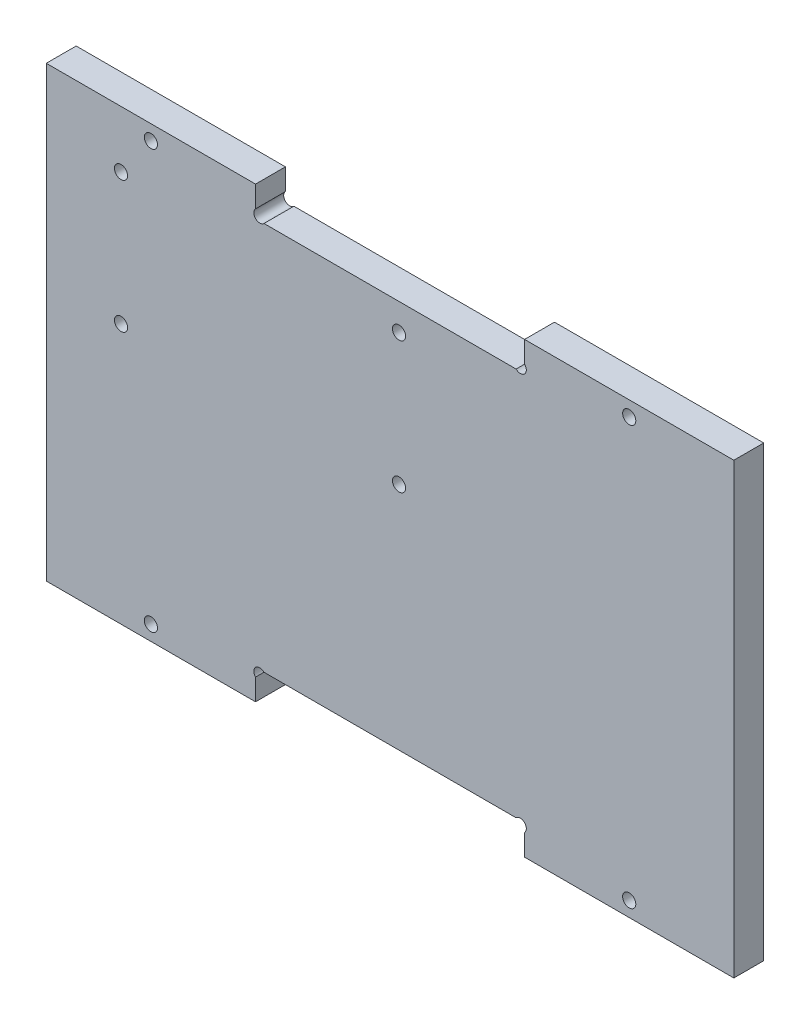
from build123d import *

# Parameters (mm, degrees)
ESQUISSE1_W               = 115
ESQUISSE1_H               = 75
BOSS_EXTRU_1_DEPTH        = 5
ENL_V_MAT_EXTRU_2_REACH   = 139.386
ESQUISSE3_R               = 1.1
ENL_V_MAT_EXTRU_4_REACH   = 139.386
ESQUISSE6_W               = 45
ESQUISSE6_H               = 5
ENL_V_START               = -5
ESQUISSE7_R               = 1
ENL_V_MAT_EXTRU_5_DEPTH   = 5
ENL_V_MAT_EXTRU_6_REACH   = 139.386
ESQUISSE8_R               = 1.1
SYM_TRIE2_COPY_1_REACH    = 139.386
SYM_TRIE2_COPY_1_SKETCH_R = 1.1


with BuildPart() as part:
    # Esquisse1 → Boss.-Extru.1 (new body)
    with BuildSketch(Plane.XY):
        with Locations((57.5, 37.5)):
            Rectangle(ESQUISSE1_W, ESQUISSE1_H)
    extrude(amount=BOSS_EXTRU_1_DEPTH)

    # Esquisse3 → Enl_v. mat.-Extru.2 (cut, up to next)
    with BuildSketch(Plane.XY.offset(5), mode=Mode.PRIVATE) as enl_v_mat_extru_2_sk1:
        with Locations((12.5, 65.5)):
            Circle(ESQUISSE3_R)
    enl_v_mat_extru_2_tool1 = extrude(enl_v_mat_extru_2_sk1.sketch, amount=-ENL_V_MAT_EXTRU_2_REACH, mode=Mode.PRIVATE) & part.part
    # Esquisse3 → Enl_v. mat.-Extru.2 (cut, up to next)
    with BuildSketch(Plane.XY.offset(5), mode=Mode.PRIVATE) as enl_v_mat_extru_2_sk2:
        with Locations((59, 65.5)):
            Circle(ESQUISSE3_R)
    enl_v_mat_extru_2_tool2 = extrude(enl_v_mat_extru_2_sk2.sketch, amount=-ENL_V_MAT_EXTRU_2_REACH, mode=Mode.PRIVATE) & part.part
    # Esquisse3 → Enl_v. mat.-Extru.2 (cut, up to next)
    with BuildSketch(Plane.XY.offset(5), mode=Mode.PRIVATE) as enl_v_mat_extru_2_sk3:
        with Locations((59, 43.5)):
            Circle(ESQUISSE3_R)
    enl_v_mat_extru_2_tool3 = extrude(enl_v_mat_extru_2_sk3.sketch, amount=-ENL_V_MAT_EXTRU_2_REACH, mode=Mode.PRIVATE) & part.part
    # Esquisse3 → Enl_v. mat.-Extru.2 (cut, up to next)
    with BuildSketch(Plane.XY.offset(5), mode=Mode.PRIVATE) as enl_v_mat_extru_2_sk4:
        with Locations((12.5, 43.5)):
            Circle(ESQUISSE3_R)
    enl_v_mat_extru_2_tool4 = extrude(enl_v_mat_extru_2_sk4.sketch, amount=-ENL_V_MAT_EXTRU_2_REACH, mode=Mode.PRIVATE) & part.part
    add(enl_v_mat_extru_2_tool1.solids().sort_by_distance((12.5, 65.5, 5))[0], mode=Mode.SUBTRACT)
    add(enl_v_mat_extru_2_tool2.solids().sort_by_distance((59, 65.5, 5))[0], mode=Mode.SUBTRACT)
    add(enl_v_mat_extru_2_tool3.solids().sort_by_distance((59, 43.5, 5))[0], mode=Mode.SUBTRACT)
    add(enl_v_mat_extru_2_tool4.solids().sort_by_distance((12.5, 43.5, 5))[0], mode=Mode.SUBTRACT)

    # Esquisse6 → Enl_v. mat.-Extru.4 (cut, up to next)
    with BuildSketch(Plane(origin=(0, 0, 0), x_dir=(-1, 0, 0), z_dir=(0, 0, -1)), mode=Mode.PRIVATE) as enl_v_mat_extru_4_sk1:
        with Locations((-57.5, 72.5)):
            Rectangle(ESQUISSE6_W, ESQUISSE6_H)
    enl_v_mat_extru_4_tool1 = extrude(enl_v_mat_extru_4_sk1.sketch, amount=-ENL_V_MAT_EXTRU_4_REACH, mode=Mode.PRIVATE) & part.part
    # Esquisse6 → Enl_v. mat.-Extru.4 (cut, up to next)
    with BuildSketch(Plane(origin=(0, 0, 0), x_dir=(-1, 0, 0), z_dir=(0, 0, -1)), mode=Mode.PRIVATE) as enl_v_mat_extru_4_sk2:
        with Locations((-57.5, 2.5)):
            Rectangle(ESQUISSE6_W, ESQUISSE6_H)
    enl_v_mat_extru_4_tool2 = extrude(enl_v_mat_extru_4_sk2.sketch, amount=-ENL_V_MAT_EXTRU_4_REACH, mode=Mode.PRIVATE) & part.part
    add(enl_v_mat_extru_4_tool1.solids().sort_by_distance((57.5, 72.5, 0))[0], mode=Mode.SUBTRACT)
    add(enl_v_mat_extru_4_tool2.solids().sort_by_distance((57.5, 2.5, 0))[0], mode=Mode.SUBTRACT)

    # Esquisse7 → Enl_v. mat.-Extru.5 (cut)
    with BuildSketch(Plane(origin=(0, 0, 0), x_dir=(-1, 0, 0), z_dir=(0, 0, -1)).offset(ENL_V_START)):
        with Locations((-35.707106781, 70.707106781)):
            Circle(ESQUISSE7_R)
        with Locations((-79.292893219, 70.707106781)):
            Circle(ESQUISSE7_R)
        with Locations((-79.292893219, 4.292893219)):
            Circle(ESQUISSE7_R)
        with Locations((-35.707106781, 4.292893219)):
            Circle(ESQUISSE7_R)
    extrude(amount=ENL_V_MAT_EXTRU_5_DEPTH, mode=Mode.SUBTRACT)

    # Esquisse8 → Enl_v. mat.-Extru.6 (cut, up to next)
    with BuildSketch(Plane(origin=(0, 0, 0), x_dir=(-1, 0, 0), z_dir=(0, 0, -1)), mode=Mode.PRIVATE) as enl_v_mat_extru_6_sk1:
        with Locations((-17.5, 72.5)):
            Circle(ESQUISSE8_R)
    enl_v_mat_extru_6_tool1 = extrude(enl_v_mat_extru_6_sk1.sketch, amount=-ENL_V_MAT_EXTRU_6_REACH, mode=Mode.PRIVATE) & part.part
    enl_v_mat_extru_6 = enl_v_mat_extru_6_tool1.solids().sort_by_distance((17.5, 72.5, 0))[0]
    add(enl_v_mat_extru_6, mode=Mode.SUBTRACT)

    # Sym_trie1: Enl_v. mat.-Extru.6 across plane
    add(enl_v_mat_extru_6.mirror(Plane(origin=(57.5, 0, 0), x_dir=(0, 0, 1), z_dir=(1, 0, 0))), mode=Mode.SUBTRACT)

    # Sym_trie2: Enl_v. mat.-Extru.6 across plane
    add(enl_v_mat_extru_6.mirror(Plane.ZX.offset(37.5)), mode=Mode.SUBTRACT)

    # Sym_trie2 copy 1 sketch → Sym_trie2 copy 1 (cut, up to next)
    with BuildSketch(Plane(origin=(115, 75, 0), x_dir=(1, 0, 0), z_dir=(0, 0, -1)), mode=Mode.PRIVATE) as sym_trie2_copy_1_sk1:
        with Locations((-17.5, 72.5)):
            Circle(SYM_TRIE2_COPY_1_SKETCH_R)
    sym_trie2_copy_1_tool1 = extrude(sym_trie2_copy_1_sk1.sketch, amount=-SYM_TRIE2_COPY_1_REACH, mode=Mode.PRIVATE) & part.part
    add(sym_trie2_copy_1_tool1.solids().sort_by_distance((97.5, 2.5, 0))[0], mode=Mode.SUBTRACT)


solid = part.part
